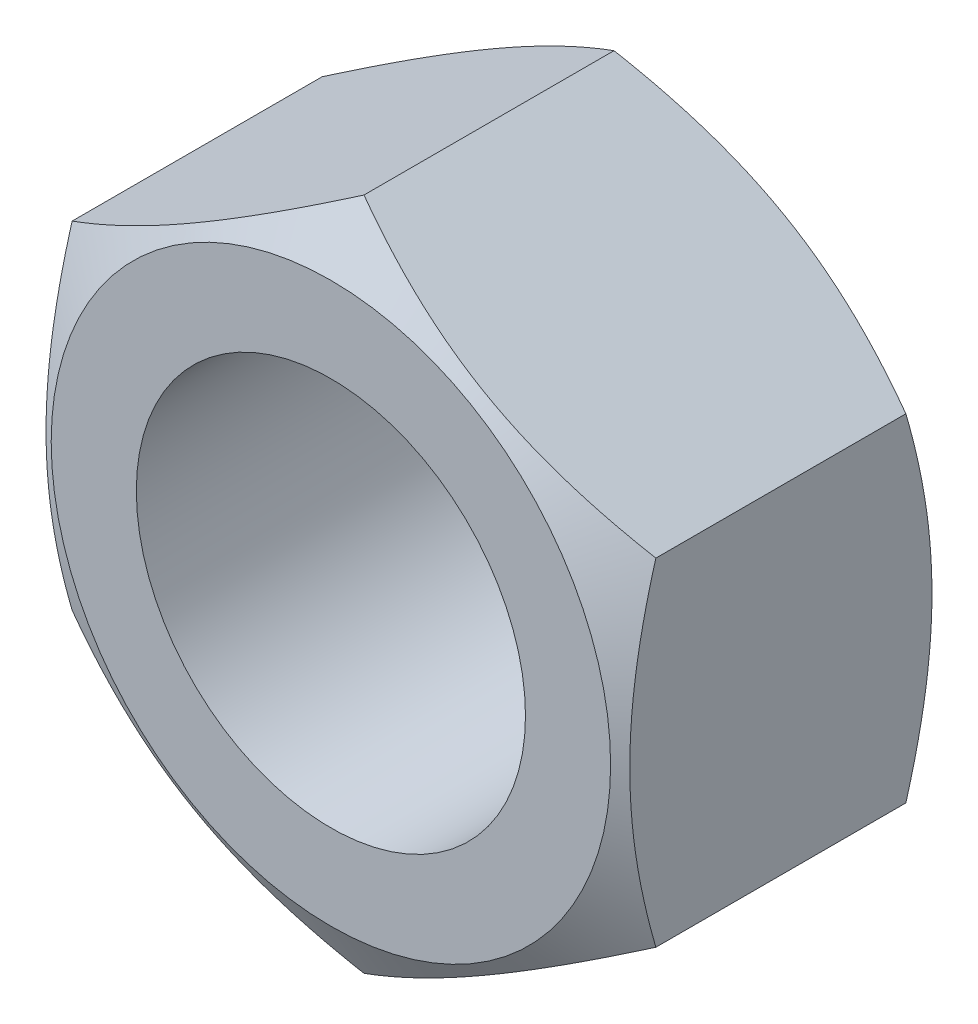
ISO-10303-21;
HEADER;
FILE_DESCRIPTION(('STEP AP214'),'2;1');
FILE_NAME('part.step','',(''),(''),'','','');
FILE_SCHEMA(('AUTOMOTIVE_DESIGN { 1 0 10303 214 1 1 1 1 }'));
ENDSEC;
DATA;
#1=APPLICATION_CONTEXT('core data for automotive mechanical design processes');
#2=APPLICATION_PROTOCOL_DEFINITION('international standard','automotive_design',2000,#1);
#3=PRODUCT_CONTEXT('',#1,'mechanical');
#4=PRODUCT('Part','Part','',(#3));
#5=PRODUCT_RELATED_PRODUCT_CATEGORY('part','',(#4));
#6=PRODUCT_DEFINITION_FORMATION('','',#4);
#7=PRODUCT_DEFINITION_CONTEXT('part definition',#1,'design');
#8=PRODUCT_DEFINITION('design','',#6,#7);
#9=PRODUCT_DEFINITION_SHAPE('','',#8);
#10=(LENGTH_UNIT() NAMED_UNIT(*) SI_UNIT(.MILLI.,.METRE.));
#11=(NAMED_UNIT(*) PLANE_ANGLE_UNIT() SI_UNIT($,.RADIAN.));
#12=(NAMED_UNIT(*) SI_UNIT($,.STERADIAN.) SOLID_ANGLE_UNIT());
#13=UNCERTAINTY_MEASURE_WITH_UNIT(LENGTH_MEASURE(1.E-05),#10,'distance_accuracy_value','');
#14=(GEOMETRIC_REPRESENTATION_CONTEXT(3) GLOBAL_UNCERTAINTY_ASSIGNED_CONTEXT((#13)) GLOBAL_UNIT_ASSIGNED_CONTEXT((#10,
#11,#12)) REPRESENTATION_CONTEXT('',''));
#15=CARTESIAN_POINT('',(0.,0.,0.));
#16=DIRECTION('',(0.,0.,1.));
#17=DIRECTION('',(1.,0.,0.));
#18=AXIS2_PLACEMENT_3D('',#15,#16,#17);
#19=CARTESIAN_POINT('',(-12.,-6.92820323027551,13.));
#20=DIRECTION('',(-1.,0.,0.));
#21=DIRECTION('',(0.,0.,1.));
#22=AXIS2_PLACEMENT_3D('',#19,#20,#21);
#23=PLANE('',#22);
#24=DIRECTION('',(0.,0.,-1.));
#25=VECTOR('',#24,1.);
#26=CARTESIAN_POINT('',(-12.,-6.92820323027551,13.));
#27=LINE('',#26,#25);
#28=CARTESIAN_POINT('',(-12.,-6.92820323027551,11.6395280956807));
#29=VERTEX_POINT('',#28);
#30=CARTESIAN_POINT('',(-12.,-6.92820323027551,1.36047190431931));
#31=VERTEX_POINT('',#30);
#32=EDGE_CURVE('E29',#29,#31,#27,.T.);
#33=ORIENTED_EDGE('',*,*,#32,.F.);
#34=CARTESIAN_POINT('',(-12.,-18.5511120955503,6.88356530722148));
#35=CARTESIAN_POINT('',(-12.,-18.2893056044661,7.01047861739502));
#36=CARTESIAN_POINT('',(-12.,-18.0271902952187,7.13675456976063));
#37=CARTESIAN_POINT('',(-12.,-17.5022775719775,7.38788728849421));
#38=CARTESIAN_POINT('',(-12.,-17.2394801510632,7.51274404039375));
#39=CARTESIAN_POINT('',(-12.,-16.4498972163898,7.88500207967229));
#40=CARTESIAN_POINT('',(-12.,-15.9219993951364,8.13005305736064));
#41=CARTESIAN_POINT('',(-12.,-14.8597501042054,8.61372635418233));
#42=CARTESIAN_POINT('',(-12.,-14.325379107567,8.85230589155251));
#43=CARTESIAN_POINT('',(-12.,-13.2523667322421,9.31962618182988));
#44=CARTESIAN_POINT('',(-12.,-12.7137255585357,9.54836740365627));
#45=CARTESIAN_POINT('',(-12.,-11.6141666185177,10.0004566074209));
#46=CARTESIAN_POINT('',(-12.,-11.053083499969,10.223404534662));
#47=CARTESIAN_POINT('',(-12.,-9.92432726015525,10.6522845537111));
#48=CARTESIAN_POINT('',(-12.,-9.35665340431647,10.8582147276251));
#49=CARTESIAN_POINT('',(-12.,-8.21491291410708,11.2476070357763));
#50=CARTESIAN_POINT('',(-12.,-7.64086209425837,11.4311151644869));
#51=CARTESIAN_POINT('',(-12.,-6.48447180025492,11.7697460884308));
#52=CARTESIAN_POINT('',(-12.,-5.90213501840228,11.9248778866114));
#53=CARTESIAN_POINT('',(-12.,-5.02392332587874,12.1302284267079));
#54=CARTESIAN_POINT('',(-12.,-4.73119449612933,12.1939857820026));
#55=CARTESIAN_POINT('',(-12.,-4.14374776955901,12.3116189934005));
#56=CARTESIAN_POINT('',(-12.,-3.84902991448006,12.3654950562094));
#57=CARTESIAN_POINT('',(-12.,-3.25781233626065,12.4624111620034));
#58=CARTESIAN_POINT('',(-12.,-2.96131263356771,12.5054513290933));
#59=CARTESIAN_POINT('',(-12.,-2.36685078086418,12.5798348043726));
#60=CARTESIAN_POINT('',(-12.,-2.06888868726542,12.6111785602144));
#61=CARTESIAN_POINT('',(-12.,-1.4757830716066,12.6611568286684));
#62=CARTESIAN_POINT('',(-12.,-1.1806530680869,12.6799507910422));
#63=CARTESIAN_POINT('',(-12.,-0.58986359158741,12.7050451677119));
#64=CARTESIAN_POINT('',(-12.,-0.294204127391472,12.7113457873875));
#65=CARTESIAN_POINT('',(-12.,0.297117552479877,12.7113038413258));
#66=CARTESIAN_POINT('',(-12.,0.592779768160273,12.7049611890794));
#67=CARTESIAN_POINT('',(-12.,1.18357555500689,12.6797863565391));
#68=CARTESIAN_POINT('',(-12.,1.47870910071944,12.6609535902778));
#69=CARTESIAN_POINT('',(-12.,2.18979135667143,12.6009289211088));
#70=CARTESIAN_POINT('',(-12.,2.60524027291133,12.5537118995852));
#71=CARTESIAN_POINT('',(-12.,3.43301837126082,12.4371140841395));
#72=CARTESIAN_POINT('',(-12.,3.84534711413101,12.3677302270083));
#73=CARTESIAN_POINT('',(-12.,4.66650397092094,12.2092670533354));
#74=CARTESIAN_POINT('',(-12.,5.07532906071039,12.1201722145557));
#75=CARTESIAN_POINT('',(-12.,5.88886052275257,11.9250022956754));
#76=CARTESIAN_POINT('',(-12.,6.29356696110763,11.8189274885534));
#77=CARTESIAN_POINT('',(-12.,7.10774269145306,11.5898730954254));
#78=CARTESIAN_POINT('',(-12.,7.51712127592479,11.466573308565));
#79=CARTESIAN_POINT('',(-12.,8.3318448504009,11.2073659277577));
#80=CARTESIAN_POINT('',(-12.,8.73718981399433,11.0714582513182));
#81=CARTESIAN_POINT('',(-12.,9.54404896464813,10.7891815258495));
#82=CARTESIAN_POINT('',(-12.,9.94556440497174,10.6428160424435));
#83=CARTESIAN_POINT('',(-12.,10.7452767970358,10.3413327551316));
#84=CARTESIAN_POINT('',(-12.,11.1434737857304,10.18621504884));
#85=CARTESIAN_POINT('',(-12.,12.0754680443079,9.81323891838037));
#86=CARTESIAN_POINT('',(-12.,12.6080647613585,9.59238523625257));
#87=CARTESIAN_POINT('',(-12.,13.6688002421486,9.14019003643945));
#88=CARTESIAN_POINT('',(-12.,14.1969387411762,8.90884790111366));
#89=CARTESIAN_POINT('',(-12.,15.2495787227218,8.43775599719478));
#90=CARTESIAN_POINT('',(-12.,15.7740794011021,8.19800443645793));
#91=CARTESIAN_POINT('',(-12.,16.8199320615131,7.71177289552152));
#92=CARTESIAN_POINT('',(-12.,17.3412841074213,7.46529305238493));
#93=CARTESIAN_POINT('',(-12.,18.3819084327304,6.96658700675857));
#94=CARTESIAN_POINT('',(-12.,18.9011779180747,6.71435498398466));
#95=CARTESIAN_POINT('',(-12.,19.9374970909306,6.20537220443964));
#96=CARTESIAN_POINT('',(-12.,20.4545467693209,5.94862142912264));
#97=CARTESIAN_POINT('',(-12.,21.4867006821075,5.43140110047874));
#98=CARTESIAN_POINT('',(-12.,22.0018051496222,5.17093201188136));
#99=CARTESIAN_POINT('',(-12.,23.0304116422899,4.64684705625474));
#100=CARTESIAN_POINT('',(-12.,23.5439136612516,4.38323117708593));
#101=CARTESIAN_POINT('',(-12.,24.9976252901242,3.63219356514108));
#102=CARTESIAN_POINT('',(-12.,25.9362166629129,3.14163958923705));
#103=CARTESIAN_POINT('',(-12.,27.8099140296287,2.15385898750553));
#104=CARTESIAN_POINT('',(-12.,28.745019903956,1.65663213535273));
#105=CARTESIAN_POINT('',(-12.,30.6102319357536,0.65827060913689));
#106=CARTESIAN_POINT('',(-12.,31.5403447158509,0.157148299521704));
#107=CARTESIAN_POINT('',(-12.,32.9338661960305,-0.59751506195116));
#108=CARTESIAN_POINT('',(-12.,33.3980865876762,-0.84955951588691));
#109=CARTESIAN_POINT('',(-12.,34.326039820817,-1.35454271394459));
#110=CARTESIAN_POINT('',(-12.,34.7897726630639,-1.60748145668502));
#111=CARTESIAN_POINT('',(-12.,35.2532891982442,-1.86081608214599));
#112=B_SPLINE_CURVE_WITH_KNOTS('',3,(#34,#35,#36,#37,#38,#39,#40,#41,#42,#43,#44,#45,#46,#47,
#48,#49,#50,#51,#52,#53,#54,#55,#56,#57,#58,#59,#60,#61,#62,#63,#64,#65,#66,#67,#68,#69,#70,#71,
#72,#73,#74,#75,#76,#77,#78,#79,#80,#81,#82,#83,#84,#85,#86,#87,#88,#89,#90,#91,#92,#93,#94,#95,
#96,#97,#98,#99,#100,#101,#102,#103,#104,#105,#106,#107,#108,#109,#110,#111),.UNSPECIFIED.,.F.,
.F.,(4,2,2,2,2,2,2,2,2,2,2,2,2,2,2,2,2,2,2,2,2,2,2,2,2,2,2,2,2,2,2,2,2,2,2,2,2,2,4),(0.,
0.872836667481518,1.74568222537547,3.49163472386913,5.24719213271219,7.00266577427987,
8.81371989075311,10.624977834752,12.4324556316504,14.2393589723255,15.1379941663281,
16.03661055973,16.9352166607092,17.8337883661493,18.7207143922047,19.6076258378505,
20.4945433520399,21.3815024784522,22.6351779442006,23.8890267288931,25.1438664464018,
26.3986859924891,27.6810742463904,28.9634708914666,30.2454323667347,31.5273795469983,
33.2569446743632,34.9866117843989,36.7166497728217,38.4466525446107,40.1784911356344,
41.9103368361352,43.6419679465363,45.3736057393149,48.5507294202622,51.7279611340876,
54.89750618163,56.4821955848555,58.0668825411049),.UNSPECIFIED.);
#113=CARTESIAN_POINT('',(-12.,6.92820323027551,11.6395280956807));
#114=VERTEX_POINT('',#113);
#115=EDGE_CURVE('E76',#29,#114,#112,.T.);
#116=ORIENTED_EDGE('',*,*,#115,.T.);
#117=DIRECTION('',(0.,0.,-1.));
#118=VECTOR('',#117,1.);
#119=CARTESIAN_POINT('',(-12.,6.92820323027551,13.));
#120=LINE('',#119,#118);
#121=CARTESIAN_POINT('',(-12.,6.92820323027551,1.36047190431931));
#122=VERTEX_POINT('',#121);
#123=EDGE_CURVE('E44',#114,#122,#120,.T.);
#124=ORIENTED_EDGE('',*,*,#123,.T.);
#125=CARTESIAN_POINT('',(-12.,-18.4544512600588,6.06961259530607));
#126=CARTESIAN_POINT('',(-12.,-18.1930402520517,5.9430868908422));
#127=CARTESIAN_POINT('',(-12.,-17.9313182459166,5.81720403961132));
#128=CARTESIAN_POINT('',(-12.,-17.4071872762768,5.56686996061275));
#129=CARTESIAN_POINT('',(-12.,-17.1447783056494,5.44241874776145));
#130=CARTESIAN_POINT('',(-12.,-16.3563514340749,5.07139761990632));
#131=CARTESIAN_POINT('',(-12.,-15.8292133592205,4.82719894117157));
#132=CARTESIAN_POINT('',(-12.,-14.7684129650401,4.34528329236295));
#133=CARTESIAN_POINT('',(-12.,-14.2347306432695,4.10761024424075));
#134=CARTESIAN_POINT('',(-12.,-13.1630668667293,3.64219712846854));
#135=CARTESIAN_POINT('',(-12.,-12.6250856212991,3.41445658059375));
#136=CARTESIAN_POINT('',(-12.,-11.5272277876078,2.96468396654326));
#137=CARTESIAN_POINT('',(-12.,-10.9671887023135,2.74304643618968));
#138=CARTESIAN_POINT('',(-12.,-9.84049722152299,2.31692491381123));
#139=CARTESIAN_POINT('',(-12.,-9.2738440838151,2.11244286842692));
#140=CARTESIAN_POINT('',(-12.,-8.13415376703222,1.72611748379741));
#141=CARTESIAN_POINT('',(-12.,-7.56113272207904,1.54422693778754));
#142=CARTESIAN_POINT('',(-12.,-6.40681836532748,1.20901403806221));
#143=CARTESIAN_POINT('',(-12.,-5.82552777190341,1.05568251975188));
#144=CARTESIAN_POINT('',(-12.,-4.94889652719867,0.853144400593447));
#145=CARTESIAN_POINT('',(-12.,-4.65667790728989,0.790337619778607));
#146=CARTESIAN_POINT('',(-12.,-4.07027383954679,0.674640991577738));
#147=CARTESIAN_POINT('',(-12.,-3.77608843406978,0.621750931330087));
#148=CARTESIAN_POINT('',(-12.,-3.18596432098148,0.526830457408));
#149=CARTESIAN_POINT('',(-12.,-2.89002562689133,0.484799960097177));
#150=CARTESIAN_POINT('',(-12.,-2.29672200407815,0.412442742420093));
#151=CARTESIAN_POINT('',(-12.,-1.99935712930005,0.38211558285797));
#152=CARTESIAN_POINT('',(-12.,-1.40743040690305,0.334139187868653));
#153=CARTESIAN_POINT('',(-12.,-1.11288138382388,0.316332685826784));
#154=CARTESIAN_POINT('',(-12.,-0.52329545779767,0.293180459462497));
#155=CARTESIAN_POINT('',(-12.,-0.228258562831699,0.28783453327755));
#156=CARTESIAN_POINT('',(-12.,0.36177877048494,0.289730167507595));
#157=CARTESIAN_POINT('',(-12.,0.656779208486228,0.296971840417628));
#158=CARTESIAN_POINT('',(-12.,1.24621730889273,0.323868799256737));
#159=CARTESIAN_POINT('',(-12.,1.54065494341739,0.343524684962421));
#160=CARTESIAN_POINT('',(-12.,2.25305622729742,0.405690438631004));
#161=CARTESIAN_POINT('',(-12.,2.67049186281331,0.45435527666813));
#162=CARTESIAN_POINT('',(-12.,3.50216405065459,0.573948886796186));
#163=CARTESIAN_POINT('',(-12.,3.91640014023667,0.644880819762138));
#164=CARTESIAN_POINT('',(-12.,4.74131306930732,0.806484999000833));
#165=CARTESIAN_POINT('',(-12.,5.15198677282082,0.897173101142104));
#166=CARTESIAN_POINT('',(-12.,5.96916585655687,1.09553152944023));
#167=CARTESIAN_POINT('',(-12.,6.37567130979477,1.20320155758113));
#168=CARTESIAN_POINT('',(-12.,7.19336601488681,1.43543380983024));
#169=CARTESIAN_POINT('',(-12.,7.60446473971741,1.56031259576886));
#170=CARTESIAN_POINT('',(-12.,8.42261104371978,1.8226354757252));
#171=CARTESIAN_POINT('',(-12.,8.82965859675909,1.96007965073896));
#172=CARTESIAN_POINT('',(-12.,9.63990965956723,2.24538065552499));
#173=CARTESIAN_POINT('',(-12.,10.043114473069,2.39323379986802));
#174=CARTESIAN_POINT('',(-12.,10.8462057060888,2.69764647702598));
#175=CARTESIAN_POINT('',(-12.,11.2460921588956,2.85420592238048));
#176=CARTESIAN_POINT('',(-12.,12.1661852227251,3.22413811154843));
#177=CARTESIAN_POINT('',(-12.,12.6853472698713,3.44010450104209));
#178=CARTESIAN_POINT('',(-12.,13.7194599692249,3.88192217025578));
#179=CARTESIAN_POINT('',(-12.,14.2344103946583,4.10777397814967));
#180=CARTESIAN_POINT('',(-12.,15.2608545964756,4.56744547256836));
#181=CARTESIAN_POINT('',(-12.,15.7723476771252,4.80126670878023));
#182=CARTESIAN_POINT('',(-12.,16.7923347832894,5.27532269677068));
#183=CARTESIAN_POINT('',(-12.,17.3008288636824,5.51555733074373));
#184=CARTESIAN_POINT('',(-12.,18.3158028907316,6.00151828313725));
#185=CARTESIAN_POINT('',(-12.,18.8222803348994,6.24724981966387));
#186=CARTESIAN_POINT('',(-12.,19.8331028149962,6.74305920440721));
#187=CARTESIAN_POINT('',(-12.,20.3374478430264,6.99313706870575));
#188=CARTESIAN_POINT('',(-12.,21.3442668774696,7.49688631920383));
#189=CARTESIAN_POINT('',(-12.,21.8467410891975,7.75055729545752));
#190=CARTESIAN_POINT('',(-12.,22.8501391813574,8.2609487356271));
#191=CARTESIAN_POINT('',(-12.,23.3510630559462,8.51766921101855));
#192=CARTESIAN_POINT('',(-12.,24.7719047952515,9.25046361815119));
#193=CARTESIAN_POINT('',(-12.,25.6902386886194,9.72960883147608));
#194=CARTESIAN_POINT('',(-12.,27.5234855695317,10.6944527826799));
#195=CARTESIAN_POINT('',(-12.,28.4383984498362,11.1801517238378));
#196=CARTESIAN_POINT('',(-12.,30.2634394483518,12.1554784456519));
#197=CARTESIAN_POINT('',(-12.,31.1735737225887,12.6450947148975));
#198=CARTESIAN_POINT('',(-12.,32.5371495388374,13.3824670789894));
#199=CARTESIAN_POINT('',(-12.,32.9913926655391,13.6287430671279));
#200=CARTESIAN_POINT('',(-12.,33.8993968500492,14.1221805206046));
#201=CARTESIAN_POINT('',(-12.,34.3531579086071,14.3693419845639));
#202=CARTESIAN_POINT('',(-12.,34.8067047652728,14.6168960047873));
#203=B_SPLINE_CURVE_WITH_KNOTS('',3,(#125,#126,#127,#128,#129,#130,#131,#132,#133,#134,#135,
#136,#137,#138,#139,#140,#141,#142,#143,#144,#145,#146,#147,#148,#149,#150,#151,#152,#153,#154,
#155,#156,#157,#158,#159,#160,#161,#162,#163,#164,#165,#166,#167,#168,#169,#170,#171,#172,#173,
#174,#175,#176,#177,#178,#179,#180,#181,#182,#183,#184,#185,#186,#187,#188,#189,#190,#191,#192,
#193,#194,#195,#196,#197,#198,#199,#200,#201,#202),.UNSPECIFIED.,.F.,.F.,(4,2,2,2,2,2,2,2,2,2,2,
2,2,2,2,2,2,2,2,2,2,2,2,2,2,2,2,2,2,2,2,2,2,2,2,2,2,2,4),(0.,0.871261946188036,1.74253296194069,
3.48534103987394,5.23790247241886,6.99037907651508,8.79706873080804,10.6039631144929,
12.407015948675,14.2094891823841,15.1060240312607,16.002539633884,16.8990483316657,
17.7955233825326,18.6805267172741,19.5655157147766,20.4505126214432,21.3355522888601,
22.5956397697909,23.8559062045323,25.1171878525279,26.3784473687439,27.6671487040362,
28.9558583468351,30.2441139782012,31.532356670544,33.2190919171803,34.9059173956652,
36.5930727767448,38.2801971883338,39.9689975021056,41.6578040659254,43.3464194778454,
45.035041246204,48.1424530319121,51.2499614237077,54.3503701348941,55.9004978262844,
57.4506231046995),.UNSPECIFIED.);
#204=EDGE_CURVE('E94',#31,#122,#203,.T.);
#205=ORIENTED_EDGE('',*,*,#204,.F.);
#206=EDGE_LOOP('',(#33,#116,#124,#205));
#207=FACE_BOUND('',#206,.T.);
#208=ADVANCED_FACE('F14',(#207),#23,.T.);
#209=CARTESIAN_POINT('',(-12.,-6.92820323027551,13.));
#210=DIRECTION('',(0.5,0.86602540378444,0.));
#211=DIRECTION('',(-0.86602540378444,0.5,0.));
#212=AXIS2_PLACEMENT_3D('',#209,#210,#211);
#213=PLANE('',#212);
#214=CARTESIAN_POINT('',(-12.0002,-6.92808776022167,11.6394614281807));
#215=CARTESIAN_POINT('',(-11.7364142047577,-7.08038456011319,11.7273752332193));
#216=CARTESIAN_POINT('',(-11.4716448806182,-7.2332492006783,11.8112988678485));
#217=CARTESIAN_POINT('',(-10.9399829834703,-7.54020434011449,11.9700586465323));
#218=CARTESIAN_POINT('',(-10.6730897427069,-7.69429522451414,12.0448918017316));
#219=CARTESIAN_POINT('',(-9.86810959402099,-8.15905073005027,12.254307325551));
#220=CARTESIAN_POINT('',(-9.3268449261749,-8.47155003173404,12.3734216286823));
#221=CARTESIAN_POINT('',(-8.51686717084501,-8.93919090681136,12.513093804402));
#222=CARTESIAN_POINT('',(-8.25057389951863,-9.09293539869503,12.5528810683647));
#223=CARTESIAN_POINT('',(-7.71675440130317,-9.4011362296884,12.6196014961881));
#224=CARTESIAN_POINT('',(-7.44922815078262,-9.55559258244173,12.6465344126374));
#225=CARTESIAN_POINT('',(-6.91372963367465,-9.86476279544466,12.6868562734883));
#226=CARTESIAN_POINT('',(-6.64575827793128,-10.0194761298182,12.7002613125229));
#227=CARTESIAN_POINT('',(-6.10956726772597,-10.3290461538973,12.713241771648));
#228=CARTESIAN_POINT('',(-5.84134762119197,-10.4839028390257,12.7128176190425));
#229=CARTESIAN_POINT('',(-5.3399106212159,-10.7734076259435,12.6991048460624));
#230=CARTESIAN_POINT('',(-5.10665750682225,-10.908076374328,12.6874888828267));
#231=CARTESIAN_POINT('',(-4.64068775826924,-11.1771041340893,12.6540168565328));
#232=CARTESIAN_POINT('',(-4.40797116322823,-11.3114631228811,12.632160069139));
#233=CARTESIAN_POINT('',(-3.94320092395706,-11.5797983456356,12.5785874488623));
#234=CARTESIAN_POINT('',(-3.711147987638,-11.7137741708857,12.5468634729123));
#235=CARTESIAN_POINT('',(-3.24813003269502,-11.9810977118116,12.4741130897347));
#236=CARTESIAN_POINT('',(-3.01716508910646,-12.1144453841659,12.433086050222));
#237=CARTESIAN_POINT('',(-2.31605804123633,-12.5192297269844,12.2950132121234));
#238=CARTESIAN_POINT('',(-1.84794625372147,-12.789494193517,12.1841999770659));
#239=CARTESIAN_POINT('',(-0.918702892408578,-13.3259930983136,11.9326990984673));
#240=CARTESIAN_POINT('',(-0.457559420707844,-13.5922344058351,11.7920705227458));
#241=CARTESIAN_POINT('',(0.000200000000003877,-13.8565219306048,11.6394614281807));
#242=B_SPLINE_CURVE_WITH_KNOTS('',3,(#214,#215,#216,#217,#218,#219,#220,#221,#222,#223,#224,
#225,#226,#227,#228,#229,#230,#231,#232,#233,#234,#235,#236,#237,#238,#239,#240,#241),
.UNSPECIFIED.,.F.,.F.,(4,2,2,2,2,2,2,2,2,2,2,2,2,4),(0.,0.951004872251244,1.90232158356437,
3.80900466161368,4.7389455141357,5.66890426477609,6.59775529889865,7.5265776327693,
8.33514643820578,9.14377244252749,9.95306755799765,10.7624176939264,12.4167102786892,
14.0677556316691),.UNSPECIFIED.);
#243=CARTESIAN_POINT('',(0.,-13.856406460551,11.6395280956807));
#244=VERTEX_POINT('',#243);
#245=EDGE_CURVE('E84',#29,#244,#242,.T.);
#246=ORIENTED_EDGE('',*,*,#245,.F.);
#247=ORIENTED_EDGE('',*,*,#32,.T.);
#248=CARTESIAN_POINT('',(-12.0002,-6.92808776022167,1.3605385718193));
#249=CARTESIAN_POINT('',(-11.7364142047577,-7.08038456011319,1.27262476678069));
#250=CARTESIAN_POINT('',(-11.4716448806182,-7.23324920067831,1.18870113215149));
#251=CARTESIAN_POINT('',(-10.9399829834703,-7.54020434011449,1.02994135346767));
#252=CARTESIAN_POINT('',(-10.6730897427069,-7.69429522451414,0.955108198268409));
#253=CARTESIAN_POINT('',(-9.86810959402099,-8.15905073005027,0.745692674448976));
#254=CARTESIAN_POINT('',(-9.32684492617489,-8.47155003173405,0.626578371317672));
#255=CARTESIAN_POINT('',(-8.516867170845,-8.93919090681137,0.486906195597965));
#256=CARTESIAN_POINT('',(-8.25057389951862,-9.09293539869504,0.447118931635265));
#257=CARTESIAN_POINT('',(-7.71675440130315,-9.40113622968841,0.380398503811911));
#258=CARTESIAN_POINT('',(-7.44922815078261,-9.55559258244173,0.353465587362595));
#259=CARTESIAN_POINT('',(-6.91372963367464,-9.86476279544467,0.313143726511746));
#260=CARTESIAN_POINT('',(-6.64575827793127,-10.0194761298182,0.29973868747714));
#261=CARTESIAN_POINT('',(-6.10956726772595,-10.3290461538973,0.286758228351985));
#262=CARTESIAN_POINT('',(-5.84134762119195,-10.4839028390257,0.287182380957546));
#263=CARTESIAN_POINT('',(-5.33991062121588,-10.7734076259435,0.300895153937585));
#264=CARTESIAN_POINT('',(-5.10665750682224,-10.908076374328,0.312511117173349));
#265=CARTESIAN_POINT('',(-4.64068775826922,-11.1771041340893,0.345983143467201));
#266=CARTESIAN_POINT('',(-4.40797116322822,-11.3114631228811,0.367839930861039));
#267=CARTESIAN_POINT('',(-3.94320092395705,-11.5797983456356,0.42141255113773));
#268=CARTESIAN_POINT('',(-3.71114798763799,-11.7137741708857,0.453136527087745));
#269=CARTESIAN_POINT('',(-3.24813003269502,-11.9810977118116,0.525886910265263));
#270=CARTESIAN_POINT('',(-3.01716508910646,-12.1144453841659,0.56691394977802));
#271=CARTESIAN_POINT('',(-2.31605804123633,-12.5192297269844,0.704986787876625));
#272=CARTESIAN_POINT('',(-1.84794625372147,-12.789494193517,0.815800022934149));
#273=CARTESIAN_POINT('',(-0.918702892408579,-13.3259930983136,1.06730090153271));
#274=CARTESIAN_POINT('',(-0.457559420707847,-13.5922344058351,1.20792947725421));
#275=CARTESIAN_POINT('',(0.000199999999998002,-13.8565219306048,1.3605385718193));
#276=B_SPLINE_CURVE_WITH_KNOTS('',3,(#248,#249,#250,#251,#252,#253,#254,#255,#256,#257,#258,
#259,#260,#261,#262,#263,#264,#265,#266,#267,#268,#269,#270,#271,#272,#273,#274,#275),
.UNSPECIFIED.,.F.,.F.,(4,2,2,2,2,2,2,2,2,2,2,2,2,4),(0.,0.951004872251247,1.90232158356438,
3.80900466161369,4.73894551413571,5.6689042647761,6.59775529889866,7.52657763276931,
8.3351464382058,9.1437724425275,9.95306755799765,10.7624176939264,12.4167102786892,
14.0677556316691),.UNSPECIFIED.);
#277=CARTESIAN_POINT('',(0.,-13.856406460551,1.3604719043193));
#278=VERTEX_POINT('',#277);
#279=EDGE_CURVE('E106',#31,#278,#276,.T.);
#280=ORIENTED_EDGE('',*,*,#279,.T.);
#281=DIRECTION('',(0.,0.,-1.));
#282=VECTOR('',#281,1.);
#283=CARTESIAN_POINT('',(0.,-13.856406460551,13.));
#284=LINE('',#283,#282);
#285=EDGE_CURVE('E101',#244,#278,#284,.T.);
#286=ORIENTED_EDGE('',*,*,#285,.F.);
#287=EDGE_LOOP('',(#246,#247,#280,#286));
#288=FACE_BOUND('',#287,.T.);
#289=ADVANCED_FACE('F16',(#288),#213,.F.);
#290=CARTESIAN_POINT('',(12.,-6.9282032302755,13.));
#291=DIRECTION('',(0.5,-0.866025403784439,0.));
#292=DIRECTION('',(0.86602540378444,0.5,0.));
#293=AXIS2_PLACEMENT_3D('',#290,#291,#292);
#294=PLANE('',#293);
#295=DIRECTION('',(0.,0.,-1.));
#296=VECTOR('',#295,1.);
#297=CARTESIAN_POINT('',(12.,-6.9282032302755,13.));
#298=LINE('',#297,#296);
#299=CARTESIAN_POINT('',(12.,-6.9282032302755,11.6395280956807));
#300=VERTEX_POINT('',#299);
#301=CARTESIAN_POINT('',(12.,-6.9282032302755,1.36047190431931));
#302=VERTEX_POINT('',#301);
#303=EDGE_CURVE('E99',#300,#302,#298,.T.);
#304=ORIENTED_EDGE('',*,*,#303,.F.);
#305=CARTESIAN_POINT('',(12.0002,-6.92808776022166,11.6394614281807));
#306=CARTESIAN_POINT('',(11.7364142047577,-7.08038456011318,11.7273752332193));
#307=CARTESIAN_POINT('',(11.4716448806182,-7.2332492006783,11.8112988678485));
#308=CARTESIAN_POINT('',(10.9399829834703,-7.54020434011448,11.9700586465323));
#309=CARTESIAN_POINT('',(10.6730897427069,-7.69429522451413,12.0448918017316));
#310=CARTESIAN_POINT('',(9.86810959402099,-8.15905073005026,12.254307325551));
#311=CARTESIAN_POINT('',(9.3268449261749,-8.47155003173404,12.3734216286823));
#312=CARTESIAN_POINT('',(8.51686717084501,-8.93919090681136,12.513093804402));
#313=CARTESIAN_POINT('',(8.25057389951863,-9.09293539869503,12.5528810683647));
#314=CARTESIAN_POINT('',(7.71675440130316,-9.4011362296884,12.6196014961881));
#315=CARTESIAN_POINT('',(7.44922815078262,-9.55559258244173,12.6465344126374));
#316=CARTESIAN_POINT('',(6.91372963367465,-9.86476279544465,12.6868562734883));
#317=CARTESIAN_POINT('',(6.64575827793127,-10.0194761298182,12.7002613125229));
#318=CARTESIAN_POINT('',(6.10956726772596,-10.3290461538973,12.713241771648));
#319=CARTESIAN_POINT('',(5.84134762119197,-10.4839028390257,12.7128176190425));
#320=CARTESIAN_POINT('',(5.3399106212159,-10.7734076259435,12.6991048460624));
#321=CARTESIAN_POINT('',(5.10665750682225,-10.908076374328,12.6874888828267));
#322=CARTESIAN_POINT('',(4.64068775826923,-11.1771041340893,12.6540168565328));
#323=CARTESIAN_POINT('',(4.40797116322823,-11.3114631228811,12.632160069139));
#324=CARTESIAN_POINT('',(3.94320092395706,-11.5797983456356,12.5785874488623));
#325=CARTESIAN_POINT('',(3.711147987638,-11.7137741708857,12.5468634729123));
#326=CARTESIAN_POINT('',(3.24813003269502,-11.9810977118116,12.4741130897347));
#327=CARTESIAN_POINT('',(3.01716508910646,-12.1144453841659,12.433086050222));
#328=CARTESIAN_POINT('',(2.31605804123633,-12.5192297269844,12.2950132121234));
#329=CARTESIAN_POINT('',(1.84794625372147,-12.789494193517,12.1841999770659));
#330=CARTESIAN_POINT('',(0.918702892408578,-13.3259930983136,11.9326990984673));
#331=CARTESIAN_POINT('',(0.457559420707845,-13.5922344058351,11.7920705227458));
#332=CARTESIAN_POINT('',(-0.000200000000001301,-13.8565219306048,11.6394614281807));
#333=B_SPLINE_CURVE_WITH_KNOTS('',3,(#305,#306,#307,#308,#309,#310,#311,#312,#313,#314,#315,
#316,#317,#318,#319,#320,#321,#322,#323,#324,#325,#326,#327,#328,#329,#330,#331,#332),
.UNSPECIFIED.,.F.,.F.,(4,2,2,2,2,2,2,2,2,2,2,2,2,4),(0.,0.951004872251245,1.90232158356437,
3.80900466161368,4.7389455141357,5.66890426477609,6.59775529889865,7.5265776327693,
8.33514643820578,9.14377244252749,9.95306755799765,10.7624176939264,12.4167102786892,
14.0677556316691),.UNSPECIFIED.);
#334=EDGE_CURVE('E166',#300,#244,#333,.T.);
#335=ORIENTED_EDGE('',*,*,#334,.T.);
#336=ORIENTED_EDGE('',*,*,#285,.T.);
#337=CARTESIAN_POINT('',(12.0002,-6.92808776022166,1.3605385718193));
#338=CARTESIAN_POINT('',(11.7364142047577,-7.08038456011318,1.27262476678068));
#339=CARTESIAN_POINT('',(11.4716448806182,-7.2332492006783,1.18870113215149));
#340=CARTESIAN_POINT('',(10.9399829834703,-7.54020434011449,1.02994135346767));
#341=CARTESIAN_POINT('',(10.6730897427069,-7.69429522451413,0.955108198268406));
#342=CARTESIAN_POINT('',(9.86810959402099,-8.15905073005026,0.745692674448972));
#343=CARTESIAN_POINT('',(9.32684492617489,-8.47155003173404,0.626578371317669));
#344=CARTESIAN_POINT('',(8.516867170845,-8.93919090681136,0.486906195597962));
#345=CARTESIAN_POINT('',(8.25057389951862,-9.09293539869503,0.447118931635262));
#346=CARTESIAN_POINT('',(7.71675440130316,-9.4011362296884,0.380398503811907));
#347=CARTESIAN_POINT('',(7.44922815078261,-9.55559258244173,0.353465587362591));
#348=CARTESIAN_POINT('',(6.91372963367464,-9.86476279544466,0.313143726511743));
#349=CARTESIAN_POINT('',(6.64575827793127,-10.0194761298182,0.299738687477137));
#350=CARTESIAN_POINT('',(6.10956726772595,-10.3290461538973,0.286758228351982));
#351=CARTESIAN_POINT('',(5.84134762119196,-10.4839028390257,0.287182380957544));
#352=CARTESIAN_POINT('',(5.33991062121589,-10.7734076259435,0.300895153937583));
#353=CARTESIAN_POINT('',(5.10665750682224,-10.908076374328,0.312511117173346));
#354=CARTESIAN_POINT('',(4.64068775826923,-11.1771041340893,0.345983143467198));
#355=CARTESIAN_POINT('',(4.40797116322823,-11.3114631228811,0.367839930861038));
#356=CARTESIAN_POINT('',(3.94320092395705,-11.5797983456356,0.421412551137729));
#357=CARTESIAN_POINT('',(3.711147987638,-11.7137741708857,0.453136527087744));
#358=CARTESIAN_POINT('',(3.24813003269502,-11.9810977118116,0.525886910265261));
#359=CARTESIAN_POINT('',(3.01716508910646,-12.1144453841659,0.566913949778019));
#360=CARTESIAN_POINT('',(2.31605804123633,-12.5192297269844,0.704986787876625));
#361=CARTESIAN_POINT('',(1.84794625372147,-12.789494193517,0.815800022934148));
#362=CARTESIAN_POINT('',(0.918702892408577,-13.3259930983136,1.06730090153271));
#363=CARTESIAN_POINT('',(0.457559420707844,-13.5922344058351,1.2079294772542));
#364=CARTESIAN_POINT('',(-0.000199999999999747,-13.8565219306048,1.3605385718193));
#365=B_SPLINE_CURVE_WITH_KNOTS('',3,(#337,#338,#339,#340,#341,#342,#343,#344,#345,#346,#347,
#348,#349,#350,#351,#352,#353,#354,#355,#356,#357,#358,#359,#360,#361,#362,#363,#364),
.UNSPECIFIED.,.F.,.F.,(4,2,2,2,2,2,2,2,2,2,2,2,2,4),(0.,0.951004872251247,1.90232158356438,
3.80900466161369,4.73894551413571,5.6689042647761,6.59775529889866,7.52657763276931,
8.33514643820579,9.1437724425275,9.95306755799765,10.7624176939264,12.4167102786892,
14.0677556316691),.UNSPECIFIED.);
#366=EDGE_CURVE('E113',#302,#278,#365,.T.);
#367=ORIENTED_EDGE('',*,*,#366,.F.);
#368=EDGE_LOOP('',(#304,#335,#336,#367));
#369=FACE_BOUND('',#368,.T.);
#370=ADVANCED_FACE('F158',(#369),#294,.T.);
#371=CARTESIAN_POINT('',(12.,-6.9282032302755,13.));
#372=DIRECTION('',(-1.,0.,0.));
#373=DIRECTION('',(0.,0.,1.));
#374=AXIS2_PLACEMENT_3D('',#371,#372,#373);
#375=PLANE('',#374);
#376=CARTESIAN_POINT('',(12.,-18.5511120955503,6.88356530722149));
#377=CARTESIAN_POINT('',(12.,-18.2893056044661,7.01047861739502));
#378=CARTESIAN_POINT('',(12.,-18.0271902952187,7.13675456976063));
#379=CARTESIAN_POINT('',(12.,-17.5022775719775,7.38788728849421));
#380=CARTESIAN_POINT('',(12.,-17.2394801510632,7.51274404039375));
#381=CARTESIAN_POINT('',(12.,-16.4498972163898,7.88500207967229));
#382=CARTESIAN_POINT('',(12.,-15.9219993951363,8.13005305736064));
#383=CARTESIAN_POINT('',(12.,-14.8597501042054,8.61372635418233));
#384=CARTESIAN_POINT('',(12.,-14.325379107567,8.85230589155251));
#385=CARTESIAN_POINT('',(12.,-13.2523667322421,9.31962618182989));
#386=CARTESIAN_POINT('',(12.,-12.7137255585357,9.54836740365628));
#387=CARTESIAN_POINT('',(12.,-11.6141666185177,10.0004566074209));
#388=CARTESIAN_POINT('',(12.,-11.053083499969,10.223404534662));
#389=CARTESIAN_POINT('',(12.,-9.92432726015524,10.6522845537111));
#390=CARTESIAN_POINT('',(12.,-9.35665340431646,10.8582147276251));
#391=CARTESIAN_POINT('',(12.,-8.21491291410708,11.2476070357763));
#392=CARTESIAN_POINT('',(12.,-7.64086209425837,11.4311151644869));
#393=CARTESIAN_POINT('',(12.,-6.48447180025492,11.7697460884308));
#394=CARTESIAN_POINT('',(12.,-5.90213501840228,11.9248778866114));
#395=CARTESIAN_POINT('',(12.,-5.02392332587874,12.1302284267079));
#396=CARTESIAN_POINT('',(12.,-4.73119449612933,12.1939857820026));
#397=CARTESIAN_POINT('',(12.,-4.14374776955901,12.3116189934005));
#398=CARTESIAN_POINT('',(12.,-3.84902991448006,12.3654950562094));
#399=CARTESIAN_POINT('',(12.,-3.25781233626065,12.4624111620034));
#400=CARTESIAN_POINT('',(12.,-2.9613126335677,12.5054513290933));
#401=CARTESIAN_POINT('',(12.,-2.36685078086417,12.5798348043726));
#402=CARTESIAN_POINT('',(12.,-2.06888868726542,12.6111785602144));
#403=CARTESIAN_POINT('',(12.,-1.4757830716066,12.6611568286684));
#404=CARTESIAN_POINT('',(12.,-1.1806530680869,12.6799507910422));
#405=CARTESIAN_POINT('',(12.,-0.589863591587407,12.7050451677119));
#406=CARTESIAN_POINT('',(12.,-0.294204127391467,12.7113457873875));
#407=CARTESIAN_POINT('',(12.,0.297117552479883,12.7113038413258));
#408=CARTESIAN_POINT('',(12.,0.592779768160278,12.7049611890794));
#409=CARTESIAN_POINT('',(12.,1.18357555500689,12.6797863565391));
#410=CARTESIAN_POINT('',(12.,1.47870910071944,12.6609535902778));
#411=CARTESIAN_POINT('',(12.,2.18979135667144,12.6009289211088));
#412=CARTESIAN_POINT('',(12.,2.60524027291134,12.5537118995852));
#413=CARTESIAN_POINT('',(12.,3.43301837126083,12.4371140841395));
#414=CARTESIAN_POINT('',(12.,3.84534711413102,12.3677302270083));
#415=CARTESIAN_POINT('',(12.,4.66650397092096,12.2092670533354));
#416=CARTESIAN_POINT('',(12.,5.07532906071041,12.1201722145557));
#417=CARTESIAN_POINT('',(12.,5.88886052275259,11.9250022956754));
#418=CARTESIAN_POINT('',(12.,6.29356696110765,11.8189274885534));
#419=CARTESIAN_POINT('',(12.,7.10774269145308,11.5898730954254));
#420=CARTESIAN_POINT('',(12.,7.51712127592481,11.466573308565));
#421=CARTESIAN_POINT('',(12.,8.33184485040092,11.2073659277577));
#422=CARTESIAN_POINT('',(12.,8.73718981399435,11.0714582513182));
#423=CARTESIAN_POINT('',(12.,9.54404896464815,10.7891815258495));
#424=CARTESIAN_POINT('',(12.,9.94556440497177,10.6428160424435));
#425=CARTESIAN_POINT('',(12.,10.7452767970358,10.3413327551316));
#426=CARTESIAN_POINT('',(12.,11.1434737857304,10.18621504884));
#427=CARTESIAN_POINT('',(12.,12.0754680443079,9.81323891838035));
#428=CARTESIAN_POINT('',(12.,12.6080647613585,9.59238523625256));
#429=CARTESIAN_POINT('',(12.,13.6688002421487,9.14019003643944));
#430=CARTESIAN_POINT('',(12.,14.1969387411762,8.90884790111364));
#431=CARTESIAN_POINT('',(12.,15.2495787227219,8.43775599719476));
#432=CARTESIAN_POINT('',(12.,15.7740794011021,8.19800443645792));
#433=CARTESIAN_POINT('',(12.,16.8199320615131,7.71177289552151));
#434=CARTESIAN_POINT('',(12.,17.3412841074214,7.46529305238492));
#435=CARTESIAN_POINT('',(12.,18.3819084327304,6.96658700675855));
#436=CARTESIAN_POINT('',(12.,18.9011779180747,6.71435498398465));
#437=CARTESIAN_POINT('',(12.,19.9374970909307,6.20537220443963));
#438=CARTESIAN_POINT('',(12.,20.4545467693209,5.94862142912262));
#439=CARTESIAN_POINT('',(12.,21.4867006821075,5.43140110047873));
#440=CARTESIAN_POINT('',(12.,22.0018051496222,5.17093201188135));
#441=CARTESIAN_POINT('',(12.,23.03041164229,4.64684705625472));
#442=CARTESIAN_POINT('',(12.,23.5439136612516,4.38323117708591));
#443=CARTESIAN_POINT('',(12.,24.9976252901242,3.63219356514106));
#444=CARTESIAN_POINT('',(12.,25.9362166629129,3.14163958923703));
#445=CARTESIAN_POINT('',(12.,27.8099140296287,2.15385898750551));
#446=CARTESIAN_POINT('',(12.,28.745019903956,1.65663213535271));
#447=CARTESIAN_POINT('',(12.,30.6102319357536,0.658270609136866));
#448=CARTESIAN_POINT('',(12.,31.5403447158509,0.157148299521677));
#449=CARTESIAN_POINT('',(12.,32.9338661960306,-0.597515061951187));
#450=CARTESIAN_POINT('',(12.,33.3980865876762,-0.849559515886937));
#451=CARTESIAN_POINT('',(12.,34.3260398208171,-1.35454271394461));
#452=CARTESIAN_POINT('',(12.,34.7897726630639,-1.60748145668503));
#453=CARTESIAN_POINT('',(12.,35.2532891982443,-1.86081608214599));
#454=B_SPLINE_CURVE_WITH_KNOTS('',3,(#376,#377,#378,#379,#380,#381,#382,#383,#384,#385,#386,
#387,#388,#389,#390,#391,#392,#393,#394,#395,#396,#397,#398,#399,#400,#401,#402,#403,#404,#405,
#406,#407,#408,#409,#410,#411,#412,#413,#414,#415,#416,#417,#418,#419,#420,#421,#422,#423,#424,
#425,#426,#427,#428,#429,#430,#431,#432,#433,#434,#435,#436,#437,#438,#439,#440,#441,#442,#443,
#444,#445,#446,#447,#448,#449,#450,#451,#452,#453),.UNSPECIFIED.,.F.,.F.,(4,2,2,2,2,2,2,2,2,2,2,
2,2,2,2,2,2,2,2,2,2,2,2,2,2,2,2,2,2,2,2,2,2,2,2,2,2,2,4),(0.,0.872836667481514,1.74568222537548,
3.49163472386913,5.2471921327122,7.00266577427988,8.81371989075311,10.624977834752,
12.4324556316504,14.2393589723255,15.1379941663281,16.03661055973,16.9352166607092,
17.8337883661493,18.7207143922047,19.6076258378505,20.4945433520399,21.3815024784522,
22.6351779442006,23.8890267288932,25.1438664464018,26.3986859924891,27.6810742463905,
28.9634708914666,30.2454323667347,31.5273795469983,33.2569446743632,34.9866117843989,
36.7166497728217,38.4466525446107,40.1784911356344,41.9103368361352,43.6419679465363,
45.3736057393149,48.5507294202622,51.7279611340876,54.8975061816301,56.4821955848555,
58.066882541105),.UNSPECIFIED.);
#455=CARTESIAN_POINT('',(12.,6.92820323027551,11.6395280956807));
#456=VERTEX_POINT('',#455);
#457=EDGE_CURVE('E174',#300,#456,#454,.T.);
#458=ORIENTED_EDGE('',*,*,#457,.F.);
#459=ORIENTED_EDGE('',*,*,#303,.T.);
#460=CARTESIAN_POINT('',(12.,-18.4544512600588,6.06961259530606));
#461=CARTESIAN_POINT('',(12.,-18.1930402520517,5.94308689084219));
#462=CARTESIAN_POINT('',(12.,-17.9313182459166,5.8172040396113));
#463=CARTESIAN_POINT('',(12.,-17.4071872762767,5.56686996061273));
#464=CARTESIAN_POINT('',(12.,-17.1447783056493,5.44241874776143));
#465=CARTESIAN_POINT('',(12.,-16.3563514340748,5.07139761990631));
#466=CARTESIAN_POINT('',(12.,-15.8292133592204,4.82719894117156));
#467=CARTESIAN_POINT('',(12.,-14.76841296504,4.34528329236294));
#468=CARTESIAN_POINT('',(12.,-14.2347306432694,4.10761024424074));
#469=CARTESIAN_POINT('',(12.,-13.1630668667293,3.64219712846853));
#470=CARTESIAN_POINT('',(12.,-12.6250856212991,3.41445658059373));
#471=CARTESIAN_POINT('',(12.,-11.5272277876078,2.96468396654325));
#472=CARTESIAN_POINT('',(12.,-10.9671887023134,2.74304643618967));
#473=CARTESIAN_POINT('',(12.,-9.84049722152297,2.31692491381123));
#474=CARTESIAN_POINT('',(12.,-9.27384408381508,2.11244286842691));
#475=CARTESIAN_POINT('',(12.,-8.1341537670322,1.72611748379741));
#476=CARTESIAN_POINT('',(12.,-7.56113272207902,1.54422693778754));
#477=CARTESIAN_POINT('',(12.,-6.40681836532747,1.2090140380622));
#478=CARTESIAN_POINT('',(12.,-5.8255277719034,1.05568251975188));
#479=CARTESIAN_POINT('',(12.,-4.94889652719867,0.853144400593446));
#480=CARTESIAN_POINT('',(12.,-4.65667790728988,0.790337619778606));
#481=CARTESIAN_POINT('',(12.,-4.07027383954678,0.674640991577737));
#482=CARTESIAN_POINT('',(12.,-3.77608843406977,0.621750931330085));
#483=CARTESIAN_POINT('',(12.,-3.18596432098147,0.526830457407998));
#484=CARTESIAN_POINT('',(12.,-2.89002562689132,0.484799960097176));
#485=CARTESIAN_POINT('',(12.,-2.29672200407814,0.412442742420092));
#486=CARTESIAN_POINT('',(12.,-1.99935712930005,0.38211558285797));
#487=CARTESIAN_POINT('',(12.,-1.40743040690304,0.334139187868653));
#488=CARTESIAN_POINT('',(12.,-1.11288138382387,0.316332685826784));
#489=CARTESIAN_POINT('',(12.,-0.523295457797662,0.293180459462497));
#490=CARTESIAN_POINT('',(12.,-0.228258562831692,0.28783453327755));
#491=CARTESIAN_POINT('',(12.,0.361778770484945,0.289730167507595));
#492=CARTESIAN_POINT('',(12.,0.656779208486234,0.296971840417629));
#493=CARTESIAN_POINT('',(12.,1.24621730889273,0.323868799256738));
#494=CARTESIAN_POINT('',(12.,1.54065494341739,0.343524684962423));
#495=CARTESIAN_POINT('',(12.,2.25305622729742,0.405690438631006));
#496=CARTESIAN_POINT('',(12.,2.67049186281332,0.454355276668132));
#497=CARTESIAN_POINT('',(12.,3.50216405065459,0.573948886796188));
#498=CARTESIAN_POINT('',(12.,3.91640014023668,0.644880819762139));
#499=CARTESIAN_POINT('',(12.,4.74131306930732,0.806484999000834));
#500=CARTESIAN_POINT('',(12.,5.15198677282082,0.897173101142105));
#501=CARTESIAN_POINT('',(12.,5.96916585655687,1.09553152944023));
#502=CARTESIAN_POINT('',(12.,6.37567130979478,1.20320155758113));
#503=CARTESIAN_POINT('',(12.,7.19336601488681,1.43543380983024));
#504=CARTESIAN_POINT('',(12.,7.60446473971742,1.56031259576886));
#505=CARTESIAN_POINT('',(12.,8.42261104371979,1.8226354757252));
#506=CARTESIAN_POINT('',(12.,8.8296585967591,1.96007965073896));
#507=CARTESIAN_POINT('',(12.,9.63990965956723,2.24538065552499));
#508=CARTESIAN_POINT('',(12.,10.043114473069,2.39323379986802));
#509=CARTESIAN_POINT('',(12.,10.8462057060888,2.69764647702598));
#510=CARTESIAN_POINT('',(12.,11.2460921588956,2.85420592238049));
#511=CARTESIAN_POINT('',(12.,12.1661852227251,3.22413811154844));
#512=CARTESIAN_POINT('',(12.,12.6853472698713,3.44010450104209));
#513=CARTESIAN_POINT('',(12.,13.7194599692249,3.88192217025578));
#514=CARTESIAN_POINT('',(12.,14.2344103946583,4.10777397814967));
#515=CARTESIAN_POINT('',(12.,15.2608545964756,4.56744547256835));
#516=CARTESIAN_POINT('',(12.,15.7723476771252,4.80126670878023));
#517=CARTESIAN_POINT('',(12.,16.7923347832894,5.27532269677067));
#518=CARTESIAN_POINT('',(12.,17.3008288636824,5.51555733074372));
#519=CARTESIAN_POINT('',(12.,18.3158028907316,6.00151828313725));
#520=CARTESIAN_POINT('',(12.,18.8222803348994,6.24724981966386));
#521=CARTESIAN_POINT('',(12.,19.8331028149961,6.7430592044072));
#522=CARTESIAN_POINT('',(12.,20.3374478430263,6.99313706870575));
#523=CARTESIAN_POINT('',(12.,21.3442668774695,7.49688631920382));
#524=CARTESIAN_POINT('',(12.,21.8467410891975,7.75055729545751));
#525=CARTESIAN_POINT('',(12.,22.8501391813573,8.26094873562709));
#526=CARTESIAN_POINT('',(12.,23.3510630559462,8.51766921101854));
#527=CARTESIAN_POINT('',(12.,24.7719047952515,9.25046361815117));
#528=CARTESIAN_POINT('',(12.,25.6902386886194,9.72960883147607));
#529=CARTESIAN_POINT('',(12.,27.5234855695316,10.6944527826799));
#530=CARTESIAN_POINT('',(12.,28.4383984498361,11.1801517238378));
#531=CARTESIAN_POINT('',(12.,30.2634394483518,12.1554784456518));
#532=CARTESIAN_POINT('',(12.,31.1735737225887,12.6450947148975));
#533=CARTESIAN_POINT('',(12.,32.5371495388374,13.3824670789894));
#534=CARTESIAN_POINT('',(12.,32.991392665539,13.6287430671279));
#535=CARTESIAN_POINT('',(12.,33.8993968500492,14.1221805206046));
#536=CARTESIAN_POINT('',(12.,34.353157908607,14.3693419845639));
#537=CARTESIAN_POINT('',(12.,34.8067047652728,14.6168960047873));
#538=B_SPLINE_CURVE_WITH_KNOTS('',3,(#460,#461,#462,#463,#464,#465,#466,#467,#468,#469,#470,
#471,#472,#473,#474,#475,#476,#477,#478,#479,#480,#481,#482,#483,#484,#485,#486,#487,#488,#489,
#490,#491,#492,#493,#494,#495,#496,#497,#498,#499,#500,#501,#502,#503,#504,#505,#506,#507,#508,
#509,#510,#511,#512,#513,#514,#515,#516,#517,#518,#519,#520,#521,#522,#523,#524,#525,#526,#527,
#528,#529,#530,#531,#532,#533,#534,#535,#536,#537),.UNSPECIFIED.,.F.,.F.,(4,2,2,2,2,2,2,2,2,2,2,
2,2,2,2,2,2,2,2,2,2,2,2,2,2,2,2,2,2,2,2,2,2,2,2,2,2,2,4),(0.,0.871261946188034,1.74253296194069,
3.48534103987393,5.23790247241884,6.99037907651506,8.79706873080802,10.6039631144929,
12.407015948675,14.209489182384,15.1060240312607,16.002539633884,16.8990483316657,
17.7955233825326,18.680526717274,19.5655157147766,20.4505126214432,21.33555228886,
22.5956397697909,23.8559062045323,25.1171878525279,26.3784473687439,27.6671487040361,
28.955858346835,30.2441139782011,31.532356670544,33.2190919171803,34.9059173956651,
36.5930727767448,38.2801971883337,39.9689975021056,41.6578040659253,43.3464194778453,
45.0350412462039,48.142453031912,51.2499614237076,54.350370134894,55.9004978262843,
57.4506231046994),.UNSPECIFIED.);
#539=CARTESIAN_POINT('',(12.,6.92820323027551,1.36047190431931));
#540=VERTEX_POINT('',#539);
#541=EDGE_CURVE('E148',#302,#540,#538,.T.);
#542=ORIENTED_EDGE('',*,*,#541,.T.);
#543=DIRECTION('',(0.,0.,-1.));
#544=VECTOR('',#543,1.);
#545=CARTESIAN_POINT('',(12.,6.92820323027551,13.));
#546=LINE('',#545,#544);
#547=EDGE_CURVE('E91',#456,#540,#546,.T.);
#548=ORIENTED_EDGE('',*,*,#547,.F.);
#549=EDGE_LOOP('',(#458,#459,#542,#548));
#550=FACE_BOUND('',#549,.T.);
#551=ADVANCED_FACE('F161',(#550),#375,.F.);
#552=CARTESIAN_POINT('',(12.,6.92820323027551,13.));
#553=DIRECTION('',(-0.5,-0.86602540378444,0.));
#554=DIRECTION('',(0.86602540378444,-0.5,0.));
#555=AXIS2_PLACEMENT_3D('',#552,#553,#554);
#556=PLANE('',#555);
#557=CARTESIAN_POINT('',(12.0002,6.92808776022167,11.6394614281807));
#558=CARTESIAN_POINT('',(11.7364142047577,7.08038456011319,11.7273752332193));
#559=CARTESIAN_POINT('',(11.4716448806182,7.2332492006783,11.8112988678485));
#560=CARTESIAN_POINT('',(10.9399829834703,7.54020434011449,11.9700586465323));
#561=CARTESIAN_POINT('',(10.6730897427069,7.69429522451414,12.0448918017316));
#562=CARTESIAN_POINT('',(9.86810959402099,8.15905073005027,12.254307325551));
#563=CARTESIAN_POINT('',(9.3268449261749,8.47155003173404,12.3734216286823));
#564=CARTESIAN_POINT('',(8.51686717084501,8.93919090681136,12.513093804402));
#565=CARTESIAN_POINT('',(8.25057389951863,9.09293539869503,12.5528810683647));
#566=CARTESIAN_POINT('',(7.71675440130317,9.4011362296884,12.6196014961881));
#567=CARTESIAN_POINT('',(7.44922815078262,9.55559258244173,12.6465344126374));
#568=CARTESIAN_POINT('',(6.91372963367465,9.86476279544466,12.6868562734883));
#569=CARTESIAN_POINT('',(6.64575827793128,10.0194761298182,12.7002613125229));
#570=CARTESIAN_POINT('',(6.10956726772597,10.3290461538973,12.713241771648));
#571=CARTESIAN_POINT('',(5.84134762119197,10.4839028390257,12.7128176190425));
#572=CARTESIAN_POINT('',(5.3399106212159,10.7734076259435,12.6991048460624));
#573=CARTESIAN_POINT('',(5.10665750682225,10.908076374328,12.6874888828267));
#574=CARTESIAN_POINT('',(4.64068775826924,11.1771041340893,12.6540168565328));
#575=CARTESIAN_POINT('',(4.40797116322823,11.3114631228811,12.632160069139));
#576=CARTESIAN_POINT('',(3.94320092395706,11.5797983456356,12.5785874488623));
#577=CARTESIAN_POINT('',(3.711147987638,11.7137741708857,12.5468634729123));
#578=CARTESIAN_POINT('',(3.24813003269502,11.9810977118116,12.4741130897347));
#579=CARTESIAN_POINT('',(3.01716508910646,12.1144453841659,12.433086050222));
#580=CARTESIAN_POINT('',(2.31605804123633,12.5192297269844,12.2950132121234));
#581=CARTESIAN_POINT('',(1.84794625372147,12.789494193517,12.1841999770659));
#582=CARTESIAN_POINT('',(0.918702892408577,13.3259930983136,11.9326990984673));
#583=CARTESIAN_POINT('',(0.457559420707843,13.5922344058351,11.7920705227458));
#584=CARTESIAN_POINT('',(-0.000200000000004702,13.8565219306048,11.6394614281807));
#585=B_SPLINE_CURVE_WITH_KNOTS('',3,(#557,#558,#559,#560,#561,#562,#563,#564,#565,#566,#567,
#568,#569,#570,#571,#572,#573,#574,#575,#576,#577,#578,#579,#580,#581,#582,#583,#584),
.UNSPECIFIED.,.F.,.F.,(4,2,2,2,2,2,2,2,2,2,2,2,2,4),(0.,0.951004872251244,1.90232158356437,
3.80900466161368,4.7389455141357,5.66890426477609,6.59775529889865,7.5265776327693,
8.33514643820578,9.14377244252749,9.95306755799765,10.7624176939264,12.4167102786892,
14.0677556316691),.UNSPECIFIED.);
#586=CARTESIAN_POINT('',(0.,13.856406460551,11.6395280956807));
#587=VERTEX_POINT('',#586);
#588=EDGE_CURVE('E36',#456,#587,#585,.T.);
#589=ORIENTED_EDGE('',*,*,#588,.F.);
#590=ORIENTED_EDGE('',*,*,#547,.T.);
#591=CARTESIAN_POINT('',(12.0002,6.92808776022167,1.3605385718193));
#592=CARTESIAN_POINT('',(11.7364142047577,7.08038456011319,1.27262476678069));
#593=CARTESIAN_POINT('',(11.4716448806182,7.23324920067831,1.18870113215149));
#594=CARTESIAN_POINT('',(10.9399829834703,7.54020434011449,1.02994135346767));
#595=CARTESIAN_POINT('',(10.6730897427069,7.69429522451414,0.955108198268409));
#596=CARTESIAN_POINT('',(9.86810959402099,8.15905073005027,0.745692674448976));
#597=CARTESIAN_POINT('',(9.32684492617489,8.47155003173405,0.626578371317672));
#598=CARTESIAN_POINT('',(8.516867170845,8.93919090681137,0.486906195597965));
#599=CARTESIAN_POINT('',(8.25057389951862,9.09293539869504,0.447118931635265));
#600=CARTESIAN_POINT('',(7.71675440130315,9.40113622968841,0.380398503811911));
#601=CARTESIAN_POINT('',(7.44922815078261,9.55559258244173,0.353465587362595));
#602=CARTESIAN_POINT('',(6.91372963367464,9.86476279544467,0.313143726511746));
#603=CARTESIAN_POINT('',(6.64575827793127,10.0194761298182,0.29973868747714));
#604=CARTESIAN_POINT('',(6.10956726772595,10.3290461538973,0.286758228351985));
#605=CARTESIAN_POINT('',(5.84134762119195,10.4839028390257,0.287182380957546));
#606=CARTESIAN_POINT('',(5.33991062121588,10.7734076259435,0.300895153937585));
#607=CARTESIAN_POINT('',(5.10665750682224,10.908076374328,0.312511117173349));
#608=CARTESIAN_POINT('',(4.64068775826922,11.1771041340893,0.345983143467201));
#609=CARTESIAN_POINT('',(4.40797116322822,11.3114631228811,0.367839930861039));
#610=CARTESIAN_POINT('',(3.94320092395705,11.5797983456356,0.42141255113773));
#611=CARTESIAN_POINT('',(3.71114798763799,11.7137741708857,0.453136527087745));
#612=CARTESIAN_POINT('',(3.24813003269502,11.9810977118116,0.525886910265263));
#613=CARTESIAN_POINT('',(3.01716508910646,12.1144453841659,0.56691394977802));
#614=CARTESIAN_POINT('',(2.31605804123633,12.5192297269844,0.704986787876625));
#615=CARTESIAN_POINT('',(1.84794625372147,12.789494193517,0.815800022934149));
#616=CARTESIAN_POINT('',(0.918702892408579,13.3259930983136,1.06730090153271));
#617=CARTESIAN_POINT('',(0.457559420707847,13.5922344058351,1.20792947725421));
#618=CARTESIAN_POINT('',(-0.000199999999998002,13.8565219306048,1.3605385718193));
#619=B_SPLINE_CURVE_WITH_KNOTS('',3,(#591,#592,#593,#594,#595,#596,#597,#598,#599,#600,#601,
#602,#603,#604,#605,#606,#607,#608,#609,#610,#611,#612,#613,#614,#615,#616,#617,#618),
.UNSPECIFIED.,.F.,.F.,(4,2,2,2,2,2,2,2,2,2,2,2,2,4),(0.,0.951004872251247,1.90232158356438,
3.80900466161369,4.73894551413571,5.6689042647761,6.59775529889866,7.52657763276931,
8.3351464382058,9.1437724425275,9.95306755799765,10.7624176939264,12.4167102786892,
14.0677556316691),.UNSPECIFIED.);
#620=CARTESIAN_POINT('',(0.,13.856406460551,1.3604719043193));
#621=VERTEX_POINT('',#620);
#622=EDGE_CURVE('E139',#540,#621,#619,.T.);
#623=ORIENTED_EDGE('',*,*,#622,.T.);
#624=DIRECTION('',(0.,0.,-1.));
#625=VECTOR('',#624,1.);
#626=CARTESIAN_POINT('',(0.,13.856406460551,13.));
#627=LINE('',#626,#625);
#628=EDGE_CURVE('E88',#587,#621,#627,.T.);
#629=ORIENTED_EDGE('',*,*,#628,.F.);
#630=EDGE_LOOP('',(#589,#590,#623,#629));
#631=FACE_BOUND('',#630,.T.);
#632=ADVANCED_FACE('F200',(#631),#556,.F.);
#633=CARTESIAN_POINT('',(-12.,6.92820323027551,13.));
#634=DIRECTION('',(-0.5,0.86602540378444,0.));
#635=DIRECTION('',(-0.86602540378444,-0.5,0.));
#636=AXIS2_PLACEMENT_3D('',#633,#634,#635);
#637=PLANE('',#636);
#638=ORIENTED_EDGE('',*,*,#123,.F.);
#639=CARTESIAN_POINT('',(-12.0002,6.92808776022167,11.6394614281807));
#640=CARTESIAN_POINT('',(-11.7364142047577,7.08038456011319,11.7273752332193));
#641=CARTESIAN_POINT('',(-11.4716448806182,7.2332492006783,11.8112988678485));
#642=CARTESIAN_POINT('',(-10.9399829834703,7.54020434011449,11.9700586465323));
#643=CARTESIAN_POINT('',(-10.6730897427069,7.69429522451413,12.0448918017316));
#644=CARTESIAN_POINT('',(-9.86810959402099,8.15905073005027,12.254307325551));
#645=CARTESIAN_POINT('',(-9.3268449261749,8.47155003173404,12.3734216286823));
#646=CARTESIAN_POINT('',(-8.51686717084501,8.93919090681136,12.513093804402));
#647=CARTESIAN_POINT('',(-8.25057389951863,9.09293539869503,12.5528810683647));
#648=CARTESIAN_POINT('',(-7.71675440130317,9.4011362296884,12.6196014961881));
#649=CARTESIAN_POINT('',(-7.44922815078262,9.55559258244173,12.6465344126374));
#650=CARTESIAN_POINT('',(-6.91372963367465,9.86476279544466,12.6868562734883));
#651=CARTESIAN_POINT('',(-6.64575827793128,10.0194761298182,12.7002613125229));
#652=CARTESIAN_POINT('',(-6.10956726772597,10.3290461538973,12.713241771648));
#653=CARTESIAN_POINT('',(-5.84134762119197,10.4839028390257,12.7128176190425));
#654=CARTESIAN_POINT('',(-5.3399106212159,10.7734076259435,12.6991048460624));
#655=CARTESIAN_POINT('',(-5.10665750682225,10.908076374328,12.6874888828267));
#656=CARTESIAN_POINT('',(-4.64068775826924,11.1771041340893,12.6540168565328));
#657=CARTESIAN_POINT('',(-4.40797116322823,11.3114631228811,12.632160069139));
#658=CARTESIAN_POINT('',(-3.94320092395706,11.5797983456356,12.5785874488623));
#659=CARTESIAN_POINT('',(-3.711147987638,11.7137741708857,12.5468634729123));
#660=CARTESIAN_POINT('',(-3.24813003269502,11.9810977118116,12.4741130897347));
#661=CARTESIAN_POINT('',(-3.01716508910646,12.1144453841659,12.433086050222));
#662=CARTESIAN_POINT('',(-2.31605804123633,12.5192297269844,12.2950132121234));
#663=CARTESIAN_POINT('',(-1.84794625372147,12.789494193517,12.1841999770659));
#664=CARTESIAN_POINT('',(-0.91870289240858,13.3259930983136,11.9326990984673));
#665=CARTESIAN_POINT('',(-0.457559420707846,13.5922344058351,11.7920705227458));
#666=CARTESIAN_POINT('',(0.000200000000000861,13.8565219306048,11.6394614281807));
#667=B_SPLINE_CURVE_WITH_KNOTS('',3,(#639,#640,#641,#642,#643,#644,#645,#646,#647,#648,#649,
#650,#651,#652,#653,#654,#655,#656,#657,#658,#659,#660,#661,#662,#663,#664,#665,#666),
.UNSPECIFIED.,.F.,.F.,(4,2,2,2,2,2,2,2,2,2,2,2,2,4),(0.,0.951004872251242,1.90232158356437,
3.80900466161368,4.7389455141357,5.66890426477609,6.59775529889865,7.5265776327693,
8.33514643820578,9.14377244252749,9.95306755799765,10.7624176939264,12.4167102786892,
14.0677556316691),.UNSPECIFIED.);
#668=EDGE_CURVE('E73',#114,#587,#667,.T.);
#669=ORIENTED_EDGE('',*,*,#668,.T.);
#670=ORIENTED_EDGE('',*,*,#628,.T.);
#671=CARTESIAN_POINT('',(-12.0002,6.92808776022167,1.3605385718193));
#672=CARTESIAN_POINT('',(-11.7364142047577,7.08038456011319,1.27262476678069));
#673=CARTESIAN_POINT('',(-11.4716448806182,7.23324920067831,1.18870113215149));
#674=CARTESIAN_POINT('',(-10.9399829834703,7.54020434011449,1.02994135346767));
#675=CARTESIAN_POINT('',(-10.6730897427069,7.69429522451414,0.955108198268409));
#676=CARTESIAN_POINT('',(-9.86810959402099,8.15905073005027,0.745692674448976));
#677=CARTESIAN_POINT('',(-9.32684492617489,8.47155003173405,0.626578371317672));
#678=CARTESIAN_POINT('',(-8.516867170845,8.93919090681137,0.486906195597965));
#679=CARTESIAN_POINT('',(-8.25057389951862,9.09293539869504,0.447118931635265));
#680=CARTESIAN_POINT('',(-7.71675440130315,9.40113622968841,0.380398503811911));
#681=CARTESIAN_POINT('',(-7.44922815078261,9.55559258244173,0.353465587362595));
#682=CARTESIAN_POINT('',(-6.91372963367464,9.86476279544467,0.313143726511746));
#683=CARTESIAN_POINT('',(-6.64575827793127,10.0194761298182,0.29973868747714));
#684=CARTESIAN_POINT('',(-6.10956726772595,10.3290461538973,0.286758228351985));
#685=CARTESIAN_POINT('',(-5.84134762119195,10.4839028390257,0.287182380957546));
#686=CARTESIAN_POINT('',(-5.33991062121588,10.7734076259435,0.300895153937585));
#687=CARTESIAN_POINT('',(-5.10665750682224,10.908076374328,0.312511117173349));
#688=CARTESIAN_POINT('',(-4.64068775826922,11.1771041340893,0.345983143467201));
#689=CARTESIAN_POINT('',(-4.40797116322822,11.3114631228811,0.367839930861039));
#690=CARTESIAN_POINT('',(-3.94320092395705,11.5797983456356,0.42141255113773));
#691=CARTESIAN_POINT('',(-3.71114798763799,11.7137741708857,0.453136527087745));
#692=CARTESIAN_POINT('',(-3.24813003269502,11.9810977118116,0.525886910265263));
#693=CARTESIAN_POINT('',(-3.01716508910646,12.1144453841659,0.56691394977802));
#694=CARTESIAN_POINT('',(-2.31605804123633,12.5192297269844,0.704986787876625));
#695=CARTESIAN_POINT('',(-1.84794625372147,12.789494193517,0.815800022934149));
#696=CARTESIAN_POINT('',(-0.918702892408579,13.3259930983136,1.06730090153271));
#697=CARTESIAN_POINT('',(-0.457559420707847,13.5922344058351,1.20792947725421));
#698=CARTESIAN_POINT('',(0.000199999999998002,13.8565219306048,1.3605385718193));
#699=B_SPLINE_CURVE_WITH_KNOTS('',3,(#671,#672,#673,#674,#675,#676,#677,#678,#679,#680,#681,
#682,#683,#684,#685,#686,#687,#688,#689,#690,#691,#692,#693,#694,#695,#696,#697,#698),
.UNSPECIFIED.,.F.,.F.,(4,2,2,2,2,2,2,2,2,2,2,2,2,4),(0.,0.951004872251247,1.90232158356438,
3.80900466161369,4.73894551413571,5.6689042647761,6.59775529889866,7.52657763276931,
8.3351464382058,9.1437724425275,9.95306755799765,10.7624176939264,12.4167102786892,
14.0677556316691),.UNSPECIFIED.);
#700=EDGE_CURVE('E9',#122,#621,#699,.T.);
#701=ORIENTED_EDGE('',*,*,#700,.F.);
#702=EDGE_LOOP('',(#638,#669,#670,#701));
#703=FACE_BOUND('',#702,.T.);
#704=ADVANCED_FACE('F87',(#703),#637,.T.);
#705=CARTESIAN_POINT('',(-12.,6.92820323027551,13.));
#706=DIRECTION('',(0.,0.,1.));
#707=DIRECTION('',(1.,0.,0.));
#708=AXIS2_PLACEMENT_3D('',#705,#706,#707);
#709=PLANE('',#708);
#710=CARTESIAN_POINT('',(0.,0.,13.));
#711=DIRECTION('',(0.,0.,1.));
#712=DIRECTION('',(1.,0.,0.));
#713=AXIS2_PLACEMENT_3D('',#710,#711,#712);
#714=CIRCLE('',#713,8.);
#715=CARTESIAN_POINT('',(8.,0.,13.));
#716=VERTEX_POINT('',#715);
#717=EDGE_CURVE('E83',#716,#716,#714,.T.);
#718=ORIENTED_EDGE('',*,*,#717,.F.);
#719=EDGE_LOOP('',(#718));
#720=FACE_BOUND('',#719,.T.);
#721=CARTESIAN_POINT('',(0.,0.,13.));
#722=DIRECTION('',(0.,0.,1.));
#723=DIRECTION('',(1.,0.,0.));
#724=AXIS2_PLACEMENT_3D('',#721,#722,#723);
#725=CIRCLE('',#724,11.5);
#726=CARTESIAN_POINT('',(11.5,0.,13.));
#727=VERTEX_POINT('',#726);
#728=EDGE_CURVE('E80',#727,#727,#725,.T.);
#729=ORIENTED_EDGE('',*,*,#728,.T.);
#730=EDGE_LOOP('',(#729));
#731=FACE_BOUND('',#730,.T.);
#732=ADVANCED_FACE('F132',(#720,#731),#709,.T.);
#733=CARTESIAN_POINT('',(-12.,6.92820323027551,0.));
#734=DIRECTION('',(0.,0.,-1.));
#735=DIRECTION('',(0.,-1.,0.));
#736=AXIS2_PLACEMENT_3D('',#733,#734,#735);
#737=PLANE('',#736);
#738=CARTESIAN_POINT('',(0.,0.,0.));
#739=DIRECTION('',(0.,0.,-1.));
#740=DIRECTION('',(0.,-1.,0.));
#741=AXIS2_PLACEMENT_3D('',#738,#739,#740);
#742=CIRCLE('',#741,11.5);
#743=CARTESIAN_POINT('',(0.,-11.5,0.));
#744=VERTEX_POINT('',#743);
#745=EDGE_CURVE('E298',#744,#744,#742,.T.);
#746=ORIENTED_EDGE('',*,*,#745,.T.);
#747=EDGE_LOOP('',(#746));
#748=FACE_BOUND('',#747,.T.);
#749=CARTESIAN_POINT('',(0.,0.,0.));
#750=DIRECTION('',(0.,0.,1.));
#751=DIRECTION('',(0.,1.,0.));
#752=AXIS2_PLACEMENT_3D('',#749,#750,#751);
#753=CIRCLE('',#752,8.);
#754=CARTESIAN_POINT('',(0.,8.,0.));
#755=VERTEX_POINT('',#754);
#756=EDGE_CURVE('E89',#755,#755,#753,.T.);
#757=ORIENTED_EDGE('',*,*,#756,.T.);
#758=EDGE_LOOP('',(#757));
#759=FACE_BOUND('',#758,.T.);
#760=ADVANCED_FACE('F213',(#748,#759),#737,.T.);
#761=CARTESIAN_POINT('',(0.,0.,13.));
#762=DIRECTION('',(0.,0.,-1.));
#763=DIRECTION('',(0.,-1.,0.));
#764=AXIS2_PLACEMENT_3D('',#761,#762,#763);
#765=CYLINDRICAL_SURFACE('',#764,8.);
#766=ORIENTED_EDGE('',*,*,#717,.T.);
#767=EDGE_LOOP('',(#766));
#768=FACE_BOUND('',#767,.T.);
#769=ORIENTED_EDGE('',*,*,#756,.F.);
#770=EDGE_LOOP('',(#769));
#771=FACE_BOUND('',#770,.T.);
#772=ADVANCED_FACE('F131',(#768,#771),#765,.F.);
#773=CARTESIAN_POINT('',(0.,0.,2.22387201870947));
#774=DIRECTION('',(0.,0.,1.));
#775=DIRECTION('',(0.,1.,0.));
#776=AXIS2_PLACEMENT_3D('',#773,#774,#775);
#777=CONICAL_SURFACE('',#776,15.3518593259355,1.0471975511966);
#778=ORIENTED_EDGE('',*,*,#204,.T.);
#779=ORIENTED_EDGE('',*,*,#700,.T.);
#780=ORIENTED_EDGE('',*,*,#622,.F.);
#781=ORIENTED_EDGE('',*,*,#541,.F.);
#782=ORIENTED_EDGE('',*,*,#366,.T.);
#783=ORIENTED_EDGE('',*,*,#279,.F.);
#784=EDGE_LOOP('',(#778,#779,#780,#781,#782,#783));
#785=FACE_BOUND('',#784,.T.);
#786=ORIENTED_EDGE('',*,*,#745,.F.);
#787=EDGE_LOOP('',(#786));
#788=FACE_BOUND('',#787,.T.);
#789=ADVANCED_FACE('F109',(#785,#788),#777,.T.);
#790=CARTESIAN_POINT('',(0.,0.,13.));
#791=DIRECTION('',(0.,0.,-1.));
#792=DIRECTION('',(-1.,0.,0.));
#793=AXIS2_PLACEMENT_3D('',#790,#791,#792);
#794=CONICAL_SURFACE('',#793,11.5,1.0471975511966);
#795=ORIENTED_EDGE('',*,*,#245,.T.);
#796=ORIENTED_EDGE('',*,*,#334,.F.);
#797=ORIENTED_EDGE('',*,*,#457,.T.);
#798=ORIENTED_EDGE('',*,*,#588,.T.);
#799=ORIENTED_EDGE('',*,*,#668,.F.);
#800=ORIENTED_EDGE('',*,*,#115,.F.);
#801=EDGE_LOOP('',(#795,#796,#797,#798,#799,#800));
#802=FACE_BOUND('',#801,.T.);
#803=ORIENTED_EDGE('',*,*,#728,.F.);
#804=EDGE_LOOP('',(#803));
#805=FACE_BOUND('',#804,.T.);
#806=ADVANCED_FACE('F74',(#802,#805),#794,.T.);
#807=CLOSED_SHELL('',(#208,#289,#370,#551,#632,#704,#732,#760,#772,#789,#806));
#808=MANIFOLD_SOLID_BREP('B1',#807);
#809=ADVANCED_BREP_SHAPE_REPRESENTATION('',(#18,#808),#14);
#810=SHAPE_DEFINITION_REPRESENTATION(#9,#809);
ENDSEC;
END-ISO-10303-21;
